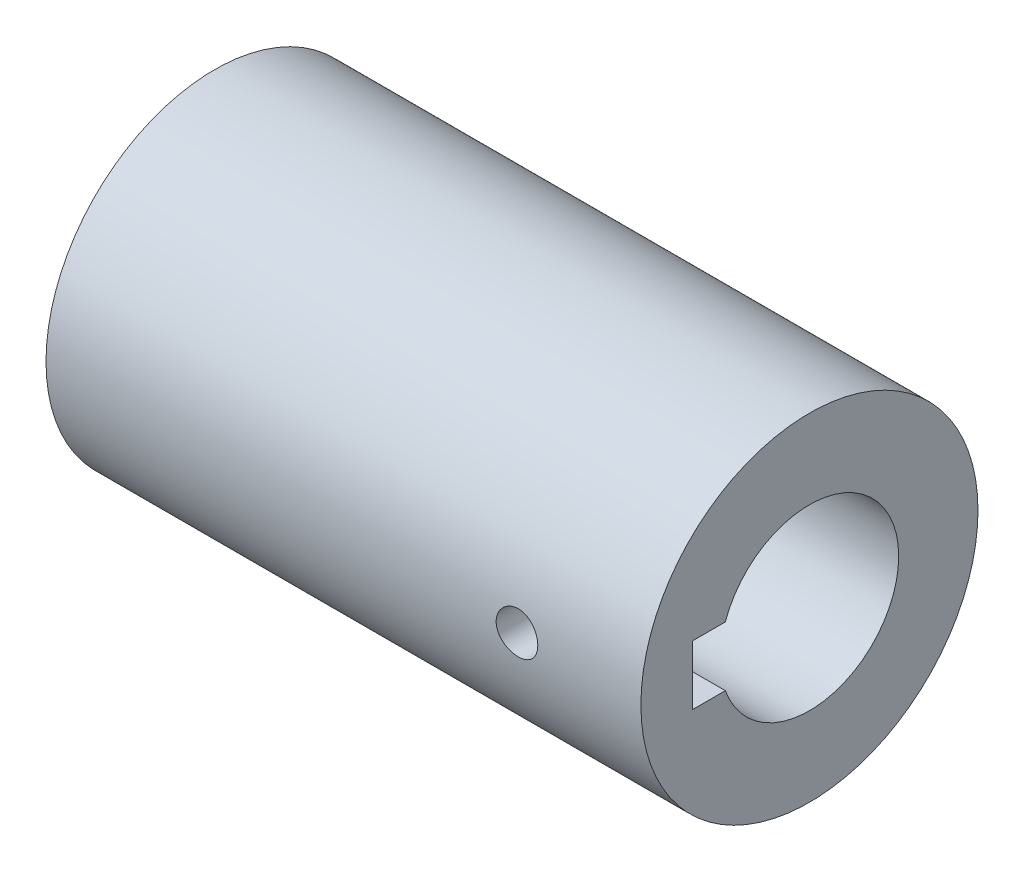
ISO-10303-21;
HEADER;
FILE_DESCRIPTION(('STEP AP214'),'2;1');
FILE_NAME('part.step','',(''),(''),'','','');
FILE_SCHEMA(('AUTOMOTIVE_DESIGN { 1 0 10303 214 1 1 1 1 }'));
ENDSEC;
DATA;
#1=APPLICATION_CONTEXT('core data for automotive mechanical design processes');
#2=APPLICATION_PROTOCOL_DEFINITION('international standard','automotive_design',2000,#1);
#3=PRODUCT_CONTEXT('',#1,'mechanical');
#4=PRODUCT('Part','Part','',(#3));
#5=PRODUCT_RELATED_PRODUCT_CATEGORY('part','',(#4));
#6=PRODUCT_DEFINITION_FORMATION('','',#4);
#7=PRODUCT_DEFINITION_CONTEXT('part definition',#1,'design');
#8=PRODUCT_DEFINITION('design','',#6,#7);
#9=PRODUCT_DEFINITION_SHAPE('','',#8);
#10=(LENGTH_UNIT() NAMED_UNIT(*) SI_UNIT(.MILLI.,.METRE.));
#11=(NAMED_UNIT(*) PLANE_ANGLE_UNIT() SI_UNIT($,.RADIAN.));
#12=(NAMED_UNIT(*) SI_UNIT($,.STERADIAN.) SOLID_ANGLE_UNIT());
#13=UNCERTAINTY_MEASURE_WITH_UNIT(LENGTH_MEASURE(1.E-05),#10,'distance_accuracy_value','');
#14=(GEOMETRIC_REPRESENTATION_CONTEXT(3) GLOBAL_UNCERTAINTY_ASSIGNED_CONTEXT((#13)) GLOBAL_UNIT_ASSIGNED_CONTEXT((#10,
#11,#12)) REPRESENTATION_CONTEXT('',''));
#15=CARTESIAN_POINT('',(0.,0.,0.));
#16=DIRECTION('',(0.,0.,1.));
#17=DIRECTION('',(1.,0.,0.));
#18=AXIS2_PLACEMENT_3D('',#15,#16,#17);
#19=CARTESIAN_POINT('',(4.,0.,0.));
#20=DIRECTION('',(1.,0.,0.));
#21=DIRECTION('',(0.,0.,-1.));
#22=AXIS2_PLACEMENT_3D('',#19,#20,#21);
#23=CYLINDRICAL_SURFACE('',#22,9.);
#24=DIRECTION('',(1.,0.,0.));
#25=VECTOR('',#24,1.);
#26=CARTESIAN_POINT('',(4.,3.,8.48528137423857));
#27=LINE('',#26,#25);
#28=CARTESIAN_POINT('',(4.,3.,8.48528137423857));
#29=VERTEX_POINT('',#28);
#30=CARTESIAN_POINT('',(30.,3.,8.48528137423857));
#31=VERTEX_POINT('',#30);
#32=EDGE_CURVE('E114',#29,#31,#27,.T.);
#33=ORIENTED_EDGE('',*,*,#32,.F.);
#34=CARTESIAN_POINT('',(4.,0.,0.));
#35=DIRECTION('',(1.,0.,0.));
#36=DIRECTION('',(0.,0.,-1.));
#37=AXIS2_PLACEMENT_3D('',#34,#35,#36);
#38=CIRCLE('',#37,9.);
#39=CARTESIAN_POINT('',(4.,-3.,8.48528137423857));
#40=VERTEX_POINT('',#39);
#41=EDGE_CURVE('E100',#40,#29,#38,.T.);
#42=ORIENTED_EDGE('',*,*,#41,.F.);
#43=DIRECTION('',(1.,0.,0.));
#44=VECTOR('',#43,1.);
#45=CARTESIAN_POINT('',(4.,-3.,8.48528137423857));
#46=LINE('',#45,#44);
#47=CARTESIAN_POINT('',(30.,-3.,8.48528137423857));
#48=VERTEX_POINT('',#47);
#49=EDGE_CURVE('E112',#40,#48,#46,.T.);
#50=ORIENTED_EDGE('',*,*,#49,.T.);
#51=CARTESIAN_POINT('',(30.,0.,0.));
#52=DIRECTION('',(1.,0.,0.));
#53=DIRECTION('',(0.,0.,-1.));
#54=AXIS2_PLACEMENT_3D('',#51,#52,#53);
#55=CIRCLE('',#54,9.);
#56=EDGE_CURVE('E125',#48,#31,#55,.T.);
#57=ORIENTED_EDGE('',*,*,#56,.T.);
#58=EDGE_LOOP('',(#33,#42,#50,#57));
#59=FACE_BOUND('',#58,.T.);
#60=ADVANCED_FACE('F47',(#59),#23,.F.);
#61=CARTESIAN_POINT('',(30.,0.,0.));
#62=DIRECTION('',(-1.,0.,0.));
#63=DIRECTION('',(0.,0.,1.));
#64=AXIS2_PLACEMENT_3D('',#61,#62,#63);
#65=CYLINDRICAL_SURFACE('',#64,17.);
#66=CARTESIAN_POINT('',(19.6,0.,17.));
#67=CARTESIAN_POINT('',(19.5999950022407,-0.117477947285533,16.9999983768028));
#68=CARTESIAN_POINT('',(19.5901088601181,-0.235029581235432,16.9987693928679));
#69=CARTESIAN_POINT('',(19.5508267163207,-0.466862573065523,16.9939849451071));
#70=CARTESIAN_POINT('',(19.5214102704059,-0.581140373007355,16.9904270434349));
#71=CARTESIAN_POINT('',(19.4439467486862,-0.803035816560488,16.9813856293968));
#72=CARTESIAN_POINT('',(19.3959121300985,-0.910657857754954,16.9759034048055));
#73=CARTESIAN_POINT('',(19.2826028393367,-1.11629246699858,16.9636232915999));
#74=CARTESIAN_POINT('',(19.2173311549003,-1.21430669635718,16.9568256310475));
#75=CARTESIAN_POINT('',(19.0710249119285,-1.39849155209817,16.9426328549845));
#76=CARTESIAN_POINT('',(18.9899161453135,-1.48460302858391,16.9352350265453));
#77=CARTESIAN_POINT('',(18.814397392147,-1.64202863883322,16.9206976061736));
#78=CARTESIAN_POINT('',(18.7199867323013,-1.71334202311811,16.9135580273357));
#79=CARTESIAN_POINT('',(18.5201606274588,-1.83936679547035,16.9003187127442));
#80=CARTESIAN_POINT('',(18.4147100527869,-1.89402288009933,16.8942224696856));
#81=CARTESIAN_POINT('',(18.1960390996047,-1.98482838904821,16.8837957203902));
#82=CARTESIAN_POINT('',(18.0828190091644,-2.02097849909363,16.8794651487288));
#83=CARTESIAN_POINT('',(17.8524362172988,-2.07356641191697,16.8730858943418));
#84=CARTESIAN_POINT('',(17.7352966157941,-2.09010398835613,16.8710256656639));
#85=CARTESIAN_POINT('',(17.499887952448,-2.10330610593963,16.8693849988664));
#86=CARTESIAN_POINT('',(17.3816189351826,-2.09997142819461,16.8698044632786));
#87=CARTESIAN_POINT('',(17.1480035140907,-2.07360562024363,16.8730652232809));
#88=CARTESIAN_POINT('',(17.0326444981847,-2.05068433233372,16.875893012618));
#89=CARTESIAN_POINT('',(16.807422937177,-1.98596730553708,16.8836307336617));
#90=CARTESIAN_POINT('',(16.6975605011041,-1.94417119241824,16.8885407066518));
#91=CARTESIAN_POINT('',(16.4861090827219,-1.84277268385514,16.8999048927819));
#92=CARTESIAN_POINT('',(16.3845432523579,-1.78312249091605,16.9063632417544));
#93=CARTESIAN_POINT('',(16.1928217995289,-1.64774327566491,16.9200932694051));
#94=CARTESIAN_POINT('',(16.1026666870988,-1.57201353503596,16.9273649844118));
#95=CARTESIAN_POINT('',(15.9356882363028,-1.40601585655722,16.9419624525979));
#96=CARTESIAN_POINT('',(15.8589590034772,-1.31565322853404,16.9492882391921));
#97=CARTESIAN_POINT('',(15.7217428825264,-1.12328104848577,16.9631224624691));
#98=CARTESIAN_POINT('',(15.6612560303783,-1.02127147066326,16.9696308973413));
#99=CARTESIAN_POINT('',(15.5582418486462,-0.808428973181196,16.98110099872));
#100=CARTESIAN_POINT('',(15.5157203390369,-0.697593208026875,16.9860621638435));
#101=CARTESIAN_POINT('',(15.449918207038,-0.470279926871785,16.9938741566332));
#102=CARTESIAN_POINT('',(15.4266367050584,-0.353802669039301,16.9967250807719));
#103=CARTESIAN_POINT('',(15.4000972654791,-0.119326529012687,16.9999828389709));
#104=CARTESIAN_POINT('',(15.3967096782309,-0.00134253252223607,17.0004054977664));
#105=CARTESIAN_POINT('',(15.409712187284,0.233511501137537,16.9988018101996));
#106=CARTESIAN_POINT('',(15.4261018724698,0.350381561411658,16.9967755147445));
#107=CARTESIAN_POINT('',(15.4780859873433,0.579308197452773,16.9905114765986));
#108=CARTESIAN_POINT('',(15.5136186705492,0.691379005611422,16.9862808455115));
#109=CARTESIAN_POINT('',(15.6028159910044,0.907970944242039,16.9760818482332));
#110=CARTESIAN_POINT('',(15.6564812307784,1.01249182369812,16.9701134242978));
#111=CARTESIAN_POINT('',(15.7807344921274,1.21159642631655,16.957064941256));
#112=CARTESIAN_POINT('',(15.8514064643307,1.30612739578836,16.9499794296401));
#113=CARTESIAN_POINT('',(16.0075482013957,1.48203224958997,16.9355066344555));
#114=CARTESIAN_POINT('',(16.093018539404,1.56340562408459,16.9281193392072));
#115=CARTESIAN_POINT('',(16.2769015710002,1.71114475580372,16.9138268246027));
#116=CARTESIAN_POINT('',(16.3753835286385,1.77742462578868,16.9069245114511));
#117=CARTESIAN_POINT('',(16.5821577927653,1.89250215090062,16.8944310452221));
#118=CARTESIAN_POINT('',(16.6904499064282,1.94130014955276,16.8888398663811));
#119=CARTESIAN_POINT('',(16.9134922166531,2.01988938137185,16.8796214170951));
#120=CARTESIAN_POINT('',(17.0282250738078,2.0497292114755,16.875989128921));
#121=CARTESIAN_POINT('',(17.2611206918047,2.08971163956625,16.8710852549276));
#122=CARTESIAN_POINT('',(17.3792832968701,2.09985513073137,16.8698135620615));
#123=CARTESIAN_POINT('',(17.6148297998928,2.10014081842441,16.869777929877));
#124=CARTESIAN_POINT('',(17.7322135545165,2.09041794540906,16.8709970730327));
#125=CARTESIAN_POINT('',(17.9636649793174,2.05153244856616,16.8757693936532));
#126=CARTESIAN_POINT('',(18.0777326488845,2.02236982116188,16.8793225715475));
#127=CARTESIAN_POINT('',(18.2992972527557,1.94547451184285,16.8883574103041));
#128=CARTESIAN_POINT('',(18.4067964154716,1.89774816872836,16.8938384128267));
#129=CARTESIAN_POINT('',(18.6122818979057,1.78509350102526,16.906112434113));
#130=CARTESIAN_POINT('',(18.7102681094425,1.72016498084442,16.9129054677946));
#131=CARTESIAN_POINT('',(18.8946361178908,1.57444797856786,16.9270934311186));
#132=CARTESIAN_POINT('',(18.9809381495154,1.49355892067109,16.9344919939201));
#133=CARTESIAN_POINT('',(19.1387956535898,1.31842632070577,16.9490252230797));
#134=CARTESIAN_POINT('',(19.2103476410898,1.2241796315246,16.9561598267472));
#135=CARTESIAN_POINT('',(19.3368994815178,1.02460628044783,16.9693904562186));
#136=CARTESIAN_POINT('',(19.3918368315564,0.91923974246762,16.9754825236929));
#137=CARTESIAN_POINT('',(19.4831597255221,0.700760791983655,16.9859014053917));
#138=CARTESIAN_POINT('',(19.5195654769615,0.587656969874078,16.9902301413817));
#139=CARTESIAN_POINT('',(19.5640537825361,0.394970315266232,16.9955882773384));
#140=CARTESIAN_POINT('',(19.5775143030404,0.316603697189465,16.9972346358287));
#141=CARTESIAN_POINT('',(19.5954890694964,0.158835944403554,16.9994410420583));
#142=CARTESIAN_POINT('',(19.6000033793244,0.0794348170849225,17.0000010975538));
#143=CARTESIAN_POINT('',(19.6,0.,17.));
#144=B_SPLINE_CURVE_WITH_KNOTS('',3,(#66,#67,#68,#69,#70,#71,#72,#73,#74,#75,#76,#77,#78,#79,
#80,#81,#82,#83,#84,#85,#86,#87,#88,#89,#90,#91,#92,#93,#94,#95,#96,#97,#98,#99,#100,#101,#102,
#103,#104,#105,#106,#107,#108,#109,#110,#111,#112,#113,#114,#115,#116,#117,#118,#119,#120,#121,
#122,#123,#124,#125,#126,#127,#128,#129,#130,#131,#132,#133,#134,#135,#136,#137,#138,#139,#140,
#141,#142,#143),.UNSPECIFIED.,.T.,.F.,(4,2,2,2,2,2,2,2,2,2,2,2,2,2,2,2,2,2,2,2,2,2,2,2,2,2,2,2,
2,2,2,2,2,2,2,2,2,2,4),(0.,0.352143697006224,0.7046565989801,1.05693404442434,1.40915046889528,
1.76305869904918,2.11698484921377,2.47207357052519,2.827149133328,3.18041048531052,
3.53365795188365,3.88493730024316,4.23622361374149,4.58845890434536,4.94070993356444,
5.29533885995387,5.64996857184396,6.00471308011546,6.35944136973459,6.71185528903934,
7.06426188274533,7.41553852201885,7.76682683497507,8.11988613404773,8.47295911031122,
8.82799360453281,9.18302112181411,9.53713485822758,9.89123253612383,10.2429332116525,
10.5946339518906,10.9462147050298,11.2977994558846,11.6516748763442,12.0056338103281,
12.3609082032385,12.7157943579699,12.953904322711,13.1920125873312),.UNSPECIFIED.);
#145=CARTESIAN_POINT('',(19.6,0.,17.));
#146=VERTEX_POINT('',#145);
#147=EDGE_CURVE('E131',#146,#146,#144,.T.);
#148=ORIENTED_EDGE('',*,*,#147,.T.);
#149=EDGE_LOOP('',(#148));
#150=FACE_BOUND('',#149,.T.);
#151=CARTESIAN_POINT('',(30.,0.,0.));
#152=DIRECTION('',(1.,0.,0.));
#153=DIRECTION('',(0.,0.,-1.));
#154=AXIS2_PLACEMENT_3D('',#151,#152,#153);
#155=CIRCLE('',#154,17.);
#156=CARTESIAN_POINT('',(30.,0.,-17.));
#157=VERTEX_POINT('',#156);
#158=EDGE_CURVE('E11',#157,#157,#155,.T.);
#159=ORIENTED_EDGE('',*,*,#158,.F.);
#160=EDGE_LOOP('',(#159));
#161=FACE_BOUND('',#160,.T.);
#162=CARTESIAN_POINT('',(-30.,0.,0.));
#163=DIRECTION('',(1.,0.,0.));
#164=DIRECTION('',(0.,0.,-1.));
#165=AXIS2_PLACEMENT_3D('',#162,#163,#164);
#166=CIRCLE('',#165,17.);
#167=CARTESIAN_POINT('',(-30.,0.,-17.));
#168=VERTEX_POINT('',#167);
#169=EDGE_CURVE('E53',#168,#168,#166,.T.);
#170=ORIENTED_EDGE('',*,*,#169,.T.);
#171=EDGE_LOOP('',(#170));
#172=FACE_BOUND('',#171,.T.);
#173=ADVANCED_FACE('F51',(#150,#161,#172),#65,.T.);
#174=CARTESIAN_POINT('',(30.,0.,0.));
#175=DIRECTION('',(1.,0.,0.));
#176=DIRECTION('',(0.,0.,-1.));
#177=AXIS2_PLACEMENT_3D('',#174,#175,#176);
#178=PLANE('',#177);
#179=DIRECTION('',(0.,0.,-1.));
#180=VECTOR('',#179,1.);
#181=CARTESIAN_POINT('',(30.,-3.,11.8));
#182=LINE('',#181,#180);
#183=CARTESIAN_POINT('',(30.,-3.,11.8));
#184=VERTEX_POINT('',#183);
#185=EDGE_CURVE('E61',#184,#48,#182,.T.);
#186=ORIENTED_EDGE('',*,*,#185,.F.);
#187=DIRECTION('',(0.,1.,0.));
#188=VECTOR('',#187,1.);
#189=CARTESIAN_POINT('',(30.,-3.,11.8));
#190=LINE('',#189,#188);
#191=CARTESIAN_POINT('',(30.,3.,11.8));
#192=VERTEX_POINT('',#191);
#193=EDGE_CURVE('E132',#184,#192,#190,.T.);
#194=ORIENTED_EDGE('',*,*,#193,.T.);
#195=DIRECTION('',(0.,0.,-1.));
#196=VECTOR('',#195,1.);
#197=CARTESIAN_POINT('',(30.,3.,11.8));
#198=LINE('',#197,#196);
#199=EDGE_CURVE('E109',#192,#31,#198,.T.);
#200=ORIENTED_EDGE('',*,*,#199,.T.);
#201=ORIENTED_EDGE('',*,*,#56,.F.);
#202=EDGE_LOOP('',(#186,#194,#200,#201));
#203=FACE_BOUND('',#202,.T.);
#204=ORIENTED_EDGE('',*,*,#158,.T.);
#205=EDGE_LOOP('',(#204));
#206=FACE_BOUND('',#205,.T.);
#207=ADVANCED_FACE('F133',(#203,#206),#178,.T.);
#208=CARTESIAN_POINT('',(-30.,0.,0.));
#209=DIRECTION('',(1.,0.,0.));
#210=DIRECTION('',(0.,0.,-1.));
#211=AXIS2_PLACEMENT_3D('',#208,#209,#210);
#212=PLANE('',#211);
#213=CARTESIAN_POINT('',(-30.,0.,0.));
#214=DIRECTION('',(-1.,0.,0.));
#215=DIRECTION('',(0.,0.,1.));
#216=AXIS2_PLACEMENT_3D('',#213,#214,#215);
#217=CIRCLE('',#216,6.35);
#218=CARTESIAN_POINT('',(-30.,0.,6.35));
#219=VERTEX_POINT('',#218);
#220=EDGE_CURVE('E120',#219,#219,#217,.T.);
#221=ORIENTED_EDGE('',*,*,#220,.F.);
#222=EDGE_LOOP('',(#221));
#223=FACE_BOUND('',#222,.T.);
#224=ORIENTED_EDGE('',*,*,#169,.F.);
#225=EDGE_LOOP('',(#224));
#226=FACE_BOUND('',#225,.T.);
#227=ADVANCED_FACE('F166',(#223,#226),#212,.F.);
#228=CARTESIAN_POINT('',(4.,0.,0.));
#229=DIRECTION('',(1.,0.,0.));
#230=DIRECTION('',(0.,0.,-1.));
#231=AXIS2_PLACEMENT_3D('',#228,#229,#230);
#232=PLANE('',#231);
#233=ORIENTED_EDGE('',*,*,#41,.T.);
#234=DIRECTION('',(0.,0.,-1.));
#235=VECTOR('',#234,1.);
#236=CARTESIAN_POINT('',(4.,3.,11.8));
#237=LINE('',#236,#235);
#238=CARTESIAN_POINT('',(4.,3.,11.8));
#239=VERTEX_POINT('',#238);
#240=EDGE_CURVE('E71',#239,#29,#237,.T.);
#241=ORIENTED_EDGE('',*,*,#240,.F.);
#242=DIRECTION('',(0.,1.,0.));
#243=VECTOR('',#242,1.);
#244=CARTESIAN_POINT('',(4.,-3.,11.8));
#245=LINE('',#244,#243);
#246=CARTESIAN_POINT('',(4.,-3.,11.8));
#247=VERTEX_POINT('',#246);
#248=EDGE_CURVE('E94',#247,#239,#245,.T.);
#249=ORIENTED_EDGE('',*,*,#248,.F.);
#250=DIRECTION('',(0.,0.,-1.));
#251=VECTOR('',#250,1.);
#252=CARTESIAN_POINT('',(4.,-3.,11.8));
#253=LINE('',#252,#251);
#254=EDGE_CURVE('E98',#247,#40,#253,.T.);
#255=ORIENTED_EDGE('',*,*,#254,.T.);
#256=EDGE_LOOP('',(#233,#241,#249,#255));
#257=FACE_BOUND('',#256,.T.);
#258=ADVANCED_FACE('F95',(#257),#232,.T.);
#259=CARTESIAN_POINT('',(-4.,0.,0.));
#260=DIRECTION('',(-1.,0.,0.));
#261=DIRECTION('',(0.,0.,1.));
#262=AXIS2_PLACEMENT_3D('',#259,#260,#261);
#263=CYLINDRICAL_SURFACE('',#262,6.35);
#264=CARTESIAN_POINT('',(-4.,0.,0.));
#265=DIRECTION('',(-1.,0.,0.));
#266=DIRECTION('',(0.,0.,1.));
#267=AXIS2_PLACEMENT_3D('',#264,#265,#266);
#268=CIRCLE('',#267,6.35);
#269=CARTESIAN_POINT('',(-4.,0.,6.35));
#270=VERTEX_POINT('',#269);
#271=EDGE_CURVE('E116',#270,#270,#268,.T.);
#272=CARTESIAN_POINT('',(-4.,0.,6.35));
#273=CARTESIAN_POINT('',(-4.27083333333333,0.,6.35));
#274=CARTESIAN_POINT('',(-4.54166666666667,0.,6.35));
#275=CARTESIAN_POINT('',(-5.08333333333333,0.,6.35));
#276=CARTESIAN_POINT('',(-5.35416666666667,0.,6.35));
#277=CARTESIAN_POINT('',(-5.89583333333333,0.,6.35));
#278=CARTESIAN_POINT('',(-6.16666666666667,0.,6.35));
#279=CARTESIAN_POINT('',(-6.70833333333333,0.,6.35));
#280=CARTESIAN_POINT('',(-6.97916666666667,0.,6.35));
#281=CARTESIAN_POINT('',(-7.52083333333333,0.,6.35));
#282=CARTESIAN_POINT('',(-7.79166666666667,0.,6.35));
#283=CARTESIAN_POINT('',(-8.33333333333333,0.,6.35));
#284=CARTESIAN_POINT('',(-8.60416666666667,0.,6.35));
#285=CARTESIAN_POINT('',(-9.14583333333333,0.,6.35));
#286=CARTESIAN_POINT('',(-9.41666666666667,0.,6.35));
#287=CARTESIAN_POINT('',(-9.95833333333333,0.,6.35));
#288=CARTESIAN_POINT('',(-10.2291666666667,0.,6.35));
#289=CARTESIAN_POINT('',(-10.7708333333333,0.,6.35));
#290=CARTESIAN_POINT('',(-11.0416666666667,0.,6.35));
#291=CARTESIAN_POINT('',(-11.5833333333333,0.,6.35));
#292=CARTESIAN_POINT('',(-11.8541666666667,0.,6.35));
#293=CARTESIAN_POINT('',(-12.3958333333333,0.,6.35));
#294=CARTESIAN_POINT('',(-12.6666666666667,0.,6.35));
#295=CARTESIAN_POINT('',(-13.2083333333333,0.,6.35));
#296=CARTESIAN_POINT('',(-13.4791666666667,0.,6.35));
#297=CARTESIAN_POINT('',(-14.0208333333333,0.,6.35));
#298=CARTESIAN_POINT('',(-14.2916666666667,0.,6.35));
#299=CARTESIAN_POINT('',(-14.8333333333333,0.,6.35));
#300=CARTESIAN_POINT('',(-15.1041666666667,0.,6.35));
#301=CARTESIAN_POINT('',(-15.6458333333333,0.,6.35));
#302=CARTESIAN_POINT('',(-15.9166666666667,0.,6.35));
#303=CARTESIAN_POINT('',(-16.4583333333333,0.,6.35));
#304=CARTESIAN_POINT('',(-16.7291666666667,0.,6.35));
#305=CARTESIAN_POINT('',(-17.2708333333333,0.,6.35));
#306=CARTESIAN_POINT('',(-17.5416666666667,0.,6.35));
#307=CARTESIAN_POINT('',(-18.0833333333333,0.,6.35));
#308=CARTESIAN_POINT('',(-18.3541666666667,0.,6.35));
#309=CARTESIAN_POINT('',(-18.8958333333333,0.,6.35));
#310=CARTESIAN_POINT('',(-19.1666666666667,0.,6.35));
#311=CARTESIAN_POINT('',(-19.7083333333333,0.,6.35));
#312=CARTESIAN_POINT('',(-19.9791666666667,0.,6.35));
#313=CARTESIAN_POINT('',(-20.5208333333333,0.,6.35));
#314=CARTESIAN_POINT('',(-20.7916666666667,0.,6.35));
#315=CARTESIAN_POINT('',(-21.3333333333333,0.,6.35));
#316=CARTESIAN_POINT('',(-21.6041666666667,0.,6.35));
#317=CARTESIAN_POINT('',(-22.1458333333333,0.,6.35));
#318=CARTESIAN_POINT('',(-22.4166666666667,0.,6.35));
#319=CARTESIAN_POINT('',(-22.9583333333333,0.,6.35));
#320=CARTESIAN_POINT('',(-23.2291666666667,0.,6.35));
#321=CARTESIAN_POINT('',(-23.7708333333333,0.,6.35));
#322=CARTESIAN_POINT('',(-24.0416666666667,0.,6.35));
#323=CARTESIAN_POINT('',(-24.5833333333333,0.,6.35));
#324=CARTESIAN_POINT('',(-24.8541666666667,0.,6.35));
#325=CARTESIAN_POINT('',(-25.3958333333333,0.,6.35));
#326=CARTESIAN_POINT('',(-25.6666666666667,0.,6.35));
#327=CARTESIAN_POINT('',(-26.2083333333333,0.,6.35));
#328=CARTESIAN_POINT('',(-26.4791666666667,0.,6.35));
#329=CARTESIAN_POINT('',(-27.0208333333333,0.,6.35));
#330=CARTESIAN_POINT('',(-27.2916666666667,0.,6.35));
#331=CARTESIAN_POINT('',(-27.8333333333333,0.,6.35));
#332=CARTESIAN_POINT('',(-28.1041666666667,0.,6.35));
#333=CARTESIAN_POINT('',(-28.6458333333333,0.,6.35));
#334=CARTESIAN_POINT('',(-28.9166666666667,0.,6.35));
#335=CARTESIAN_POINT('',(-29.4583333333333,0.,6.35));
#336=CARTESIAN_POINT('',(-29.7291666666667,0.,6.35));
#337=CARTESIAN_POINT('',(-30.,0.,6.35));
#338=B_SPLINE_CURVE_WITH_KNOTS('',3,(#272,#273,#274,#275,#276,#277,#278,#279,#280,#281,#282,
#283,#284,#285,#286,#287,#288,#289,#290,#291,#292,#293,#294,#295,#296,#297,#298,#299,#300,#301,
#302,#303,#304,#305,#306,#307,#308,#309,#310,#311,#312,#313,#314,#315,#316,#317,#318,#319,#320,
#321,#322,#323,#324,#325,#326,#327,#328,#329,#330,#331,#332,#333,#334,#335,#336,#337),
.UNSPECIFIED.,.F.,.F.,(4,2,2,2,2,2,2,2,2,2,2,2,2,2,2,2,2,2,2,2,2,2,2,2,2,2,2,2,2,2,2,2,4),(0.,
0.8125,1.625,2.4375,3.25,4.0625,4.875,5.6875,6.5,7.3125,8.125,8.9375,9.75,10.5625,11.375,
12.1875,13.,13.8125,14.625,15.4375,16.25,17.0625,17.875,18.6875,19.5,20.3125,21.125,21.9375,
22.75,23.5625,24.375,25.1875,26.),.UNSPECIFIED.);
#339=EDGE_CURVE('BSEAM165',#270,#219,#338,.T.);
#340=ORIENTED_EDGE('',*,*,#271,.F.);
#341=ORIENTED_EDGE('',*,*,#220,.T.);
#342=ORIENTED_EDGE('',*,*,#339,.T.);
#343=ORIENTED_EDGE('',*,*,#339,.F.);
#344=EDGE_LOOP('',(#340,#342,#341,#343));
#345=FACE_BOUND('',#344,.T.);
#346=ADVANCED_FACE('F165',(#345),#263,.F.);
#347=CARTESIAN_POINT('',(-4.,0.,0.));
#348=DIRECTION('',(-1.,0.,0.));
#349=DIRECTION('',(0.,0.,1.));
#350=AXIS2_PLACEMENT_3D('',#347,#348,#349);
#351=PLANE('',#350);
#352=ORIENTED_EDGE('',*,*,#271,.T.);
#353=EDGE_LOOP('',(#352));
#354=FACE_BOUND('',#353,.T.);
#355=ADVANCED_FACE('F156',(#354),#351,.T.);
#356=CARTESIAN_POINT('',(4.,3.,11.8));
#357=DIRECTION('',(0.,-1.,0.));
#358=DIRECTION('',(0.,0.,-1.));
#359=AXIS2_PLACEMENT_3D('',#356,#357,#358);
#360=PLANE('',#359);
#361=ORIENTED_EDGE('',*,*,#32,.T.);
#362=ORIENTED_EDGE('',*,*,#199,.F.);
#363=DIRECTION('',(1.,0.,0.));
#364=VECTOR('',#363,1.);
#365=CARTESIAN_POINT('',(4.,3.,11.8));
#366=LINE('',#365,#364);
#367=EDGE_CURVE('E102',#239,#192,#366,.T.);
#368=ORIENTED_EDGE('',*,*,#367,.F.);
#369=ORIENTED_EDGE('',*,*,#240,.T.);
#370=EDGE_LOOP('',(#361,#362,#368,#369));
#371=FACE_BOUND('',#370,.T.);
#372=ADVANCED_FACE('F107',(#371),#360,.T.);
#373=CARTESIAN_POINT('',(4.,-3.,11.8));
#374=DIRECTION('',(0.,-1.,0.));
#375=DIRECTION('',(0.,0.,-1.));
#376=AXIS2_PLACEMENT_3D('',#373,#374,#375);
#377=PLANE('',#376);
#378=ORIENTED_EDGE('',*,*,#254,.F.);
#379=DIRECTION('',(1.,0.,0.));
#380=VECTOR('',#379,1.);
#381=CARTESIAN_POINT('',(4.,-3.,11.8));
#382=LINE('',#381,#380);
#383=EDGE_CURVE('E106',#247,#184,#382,.T.);
#384=ORIENTED_EDGE('',*,*,#383,.T.);
#385=ORIENTED_EDGE('',*,*,#185,.T.);
#386=ORIENTED_EDGE('',*,*,#49,.F.);
#387=EDGE_LOOP('',(#378,#384,#385,#386));
#388=FACE_BOUND('',#387,.T.);
#389=ADVANCED_FACE('F151',(#388),#377,.F.);
#390=CARTESIAN_POINT('',(4.,-3.,11.8));
#391=DIRECTION('',(0.,0.,-1.));
#392=DIRECTION('',(-1.,0.,0.));
#393=AXIS2_PLACEMENT_3D('',#390,#391,#392);
#394=PLANE('',#393);
#395=CARTESIAN_POINT('',(17.5,0.,11.8));
#396=DIRECTION('',(0.,0.,-1.));
#397=DIRECTION('',(-1.,0.,0.));
#398=AXIS2_PLACEMENT_3D('',#395,#396,#397);
#399=CIRCLE('',#398,2.1);
#400=CARTESIAN_POINT('',(15.4,0.,11.8));
#401=VERTEX_POINT('',#400);
#402=EDGE_CURVE('E144',#401,#401,#399,.T.);
#403=ORIENTED_EDGE('',*,*,#402,.F.);
#404=EDGE_LOOP('',(#403));
#405=FACE_BOUND('',#404,.T.);
#406=ORIENTED_EDGE('',*,*,#193,.F.);
#407=ORIENTED_EDGE('',*,*,#383,.F.);
#408=ORIENTED_EDGE('',*,*,#248,.T.);
#409=ORIENTED_EDGE('',*,*,#367,.T.);
#410=EDGE_LOOP('',(#406,#407,#408,#409));
#411=FACE_BOUND('',#410,.T.);
#412=ADVANCED_FACE('F103',(#405,#411),#394,.T.);
#413=CARTESIAN_POINT('',(17.5,0.,17.));
#414=DIRECTION('',(0.,0.,1.));
#415=DIRECTION('',(0.,-1.,0.));
#416=AXIS2_PLACEMENT_3D('',#413,#414,#415);
#417=CYLINDRICAL_SURFACE('',#416,2.1);
#418=ORIENTED_EDGE('',*,*,#402,.T.);
#419=EDGE_LOOP('',(#418));
#420=FACE_BOUND('',#419,.T.);
#421=ORIENTED_EDGE('',*,*,#147,.F.);
#422=EDGE_LOOP('',(#421));
#423=FACE_BOUND('',#422,.T.);
#424=ADVANCED_FACE('F148',(#420,#423),#417,.F.);
#425=CLOSED_SHELL('',(#60,#173,#207,#227,#258,#346,#355,#372,#389,#412,#424));
#426=MANIFOLD_SOLID_BREP('B2',#425);
#427=ADVANCED_BREP_SHAPE_REPRESENTATION('',(#18,#426),#14);
#428=SHAPE_DEFINITION_REPRESENTATION(#9,#427);
ENDSEC;
END-ISO-10303-21;
